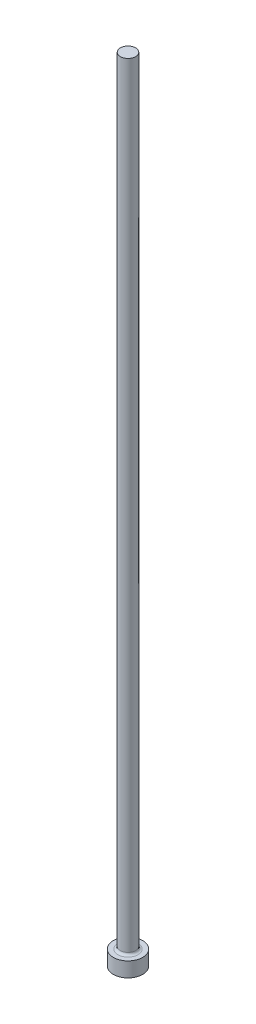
ISO-10303-21;
HEADER;
FILE_DESCRIPTION(('STEP AP214'),'2;1');
FILE_NAME('part.step','',(''),(''),'','','');
FILE_SCHEMA(('AUTOMOTIVE_DESIGN { 1 0 10303 214 1 1 1 1 }'));
ENDSEC;
DATA;
#1=APPLICATION_CONTEXT('core data for automotive mechanical design processes');
#2=APPLICATION_PROTOCOL_DEFINITION('international standard','automotive_design',2000,#1);
#3=PRODUCT_CONTEXT('',#1,'mechanical');
#4=PRODUCT('Part','Part','',(#3));
#5=PRODUCT_RELATED_PRODUCT_CATEGORY('part','',(#4));
#6=PRODUCT_DEFINITION_FORMATION('','',#4);
#7=PRODUCT_DEFINITION_CONTEXT('part definition',#1,'design');
#8=PRODUCT_DEFINITION('design','',#6,#7);
#9=PRODUCT_DEFINITION_SHAPE('','',#8);
#10=(LENGTH_UNIT() NAMED_UNIT(*) SI_UNIT(.MILLI.,.METRE.));
#11=(NAMED_UNIT(*) PLANE_ANGLE_UNIT() SI_UNIT($,.RADIAN.));
#12=(NAMED_UNIT(*) SI_UNIT($,.STERADIAN.) SOLID_ANGLE_UNIT());
#13=UNCERTAINTY_MEASURE_WITH_UNIT(LENGTH_MEASURE(1.E-05),#10,'distance_accuracy_value','');
#14=(GEOMETRIC_REPRESENTATION_CONTEXT(3) GLOBAL_UNCERTAINTY_ASSIGNED_CONTEXT((#13)) GLOBAL_UNIT_ASSIGNED_CONTEXT((#10,
#11,#12)) REPRESENTATION_CONTEXT('',''));
#15=CARTESIAN_POINT('',(0.,0.,0.));
#16=DIRECTION('',(0.,0.,1.));
#17=DIRECTION('',(1.,0.,0.));
#18=AXIS2_PLACEMENT_3D('',#15,#16,#17);
#19=CARTESIAN_POINT('',(2.44475,254.,0.));
#20=DIRECTION('',(0.,-1.,0.));
#21=DIRECTION('',(1.,0.,0.));
#22=AXIS2_PLACEMENT_3D('',#19,#20,#21);
#23=PLANE('',#22);
#24=CARTESIAN_POINT('',(0.,254.,0.));
#25=DIRECTION('',(0.,1.,0.));
#26=DIRECTION('',(-1.,0.,0.));
#27=AXIS2_PLACEMENT_3D('',#24,#25,#26);
#28=CIRCLE('',#27,2.44475000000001);
#29=CARTESIAN_POINT('',(-2.44475000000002,254.,0.));
#30=VERTEX_POINT('',#29);
#31=EDGE_CURVE('E10',#30,#30,#28,.T.);
#32=ORIENTED_EDGE('',*,*,#31,.T.);
#33=EDGE_LOOP('',(#32));
#34=FACE_BOUND('',#33,.T.);
#35=ADVANCED_FACE('F30',(#34),#23,.F.);
#36=CARTESIAN_POINT('',(0.,254.,0.));
#37=DIRECTION('',(0.,1.,0.));
#38=DIRECTION('',(-1.,0.,0.));
#39=AXIS2_PLACEMENT_3D('',#36,#37,#38);
#40=CYLINDRICAL_SURFACE('',#39,2.44475000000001);
#41=ORIENTED_EDGE('',*,*,#31,.F.);
#42=EDGE_LOOP('',(#41));
#43=FACE_BOUND('',#42,.T.);
#44=CARTESIAN_POINT('',(0.,5.51180000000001,0.));
#45=DIRECTION('',(0.,1.,0.));
#46=DIRECTION('',(-1.,0.,0.));
#47=AXIS2_PLACEMENT_3D('',#44,#45,#46);
#48=CIRCLE('',#47,2.44475);
#49=CARTESIAN_POINT('',(-2.44475,5.51180000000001,0.));
#50=VERTEX_POINT('',#49);
#51=EDGE_CURVE('E36',#50,#50,#48,.T.);
#52=ORIENTED_EDGE('',*,*,#51,.T.);
#53=EDGE_LOOP('',(#52));
#54=FACE_BOUND('',#53,.T.);
#55=ADVANCED_FACE('F65',(#43,#54),#40,.T.);
#56=CARTESIAN_POINT('',(0.,5.5118,0.));
#57=DIRECTION('',(0.,1.,0.));
#58=DIRECTION('',(-1.,0.,0.));
#59=AXIS2_PLACEMENT_3D('',#56,#57,#58);
#60=TOROIDAL_SURFACE('',#59,3.20675,0.762);
#61=ORIENTED_EDGE('',*,*,#51,.F.);
#62=EDGE_LOOP('',(#61));
#63=FACE_BOUND('',#62,.T.);
#64=CARTESIAN_POINT('',(0.,4.7498,0.));
#65=DIRECTION('',(0.,1.,0.));
#66=DIRECTION('',(-1.,0.,0.));
#67=AXIS2_PLACEMENT_3D('',#64,#65,#66);
#68=CIRCLE('',#67,3.20675);
#69=CARTESIAN_POINT('',(-3.20675,4.7498,0.));
#70=VERTEX_POINT('',#69);
#71=EDGE_CURVE('E40',#70,#70,#68,.T.);
#72=ORIENTED_EDGE('',*,*,#71,.T.);
#73=EDGE_LOOP('',(#72));
#74=FACE_BOUND('',#73,.T.);
#75=ADVANCED_FACE('F69',(#63,#74),#60,.F.);
#76=CARTESIAN_POINT('',(4.699,4.7498,0.));
#77=DIRECTION('',(0.,-1.,0.));
#78=DIRECTION('',(1.,0.,0.));
#79=AXIS2_PLACEMENT_3D('',#76,#77,#78);
#80=PLANE('',#79);
#81=ORIENTED_EDGE('',*,*,#71,.F.);
#82=EDGE_LOOP('',(#81));
#83=FACE_BOUND('',#82,.T.);
#84=CARTESIAN_POINT('',(0.,4.7498,0.));
#85=DIRECTION('',(0.,1.,0.));
#86=DIRECTION('',(-1.,0.,0.));
#87=AXIS2_PLACEMENT_3D('',#84,#85,#86);
#88=CIRCLE('',#87,4.699);
#89=CARTESIAN_POINT('',(-4.699,4.7498,0.));
#90=VERTEX_POINT('',#89);
#91=EDGE_CURVE('E44',#90,#90,#88,.T.);
#92=ORIENTED_EDGE('',*,*,#91,.T.);
#93=EDGE_LOOP('',(#92));
#94=FACE_BOUND('',#93,.T.);
#95=ADVANCED_FACE('F61',(#83,#94),#80,.F.);
#96=CARTESIAN_POINT('',(0.,254.,0.));
#97=DIRECTION('',(0.,1.,0.));
#98=DIRECTION('',(-1.,0.,0.));
#99=AXIS2_PLACEMENT_3D('',#96,#97,#98);
#100=CYLINDRICAL_SURFACE('',#99,4.699);
#101=ORIENTED_EDGE('',*,*,#91,.F.);
#102=EDGE_LOOP('',(#101));
#103=FACE_BOUND('',#102,.T.);
#104=CARTESIAN_POINT('',(0.,0.,0.));
#105=DIRECTION('',(0.,1.,0.));
#106=DIRECTION('',(-1.,0.,0.));
#107=AXIS2_PLACEMENT_3D('',#104,#105,#106);
#108=CIRCLE('',#107,4.699);
#109=CARTESIAN_POINT('',(-4.699,0.,0.));
#110=VERTEX_POINT('',#109);
#111=EDGE_CURVE('E49',#110,#110,#108,.T.);
#112=ORIENTED_EDGE('',*,*,#111,.T.);
#113=EDGE_LOOP('',(#112));
#114=FACE_BOUND('',#113,.T.);
#115=ADVANCED_FACE('F53',(#103,#114),#100,.T.);
#116=CARTESIAN_POINT('',(0.,0.,0.));
#117=DIRECTION('',(0.,1.,0.));
#118=DIRECTION('',(-1.,0.,0.));
#119=AXIS2_PLACEMENT_3D('',#116,#117,#118);
#120=PLANE('',#119);
#121=ORIENTED_EDGE('',*,*,#111,.F.);
#122=EDGE_LOOP('',(#121));
#123=FACE_BOUND('',#122,.T.);
#124=ADVANCED_FACE('F55',(#123),#120,.F.);
#125=CLOSED_SHELL('',(#35,#55,#75,#95,#115,#124));
#126=MANIFOLD_SOLID_BREP('B2',#125);
#127=ADVANCED_BREP_SHAPE_REPRESENTATION('',(#18,#126),#14);
#128=SHAPE_DEFINITION_REPRESENTATION(#9,#127);
ENDSEC;
END-ISO-10303-21;
